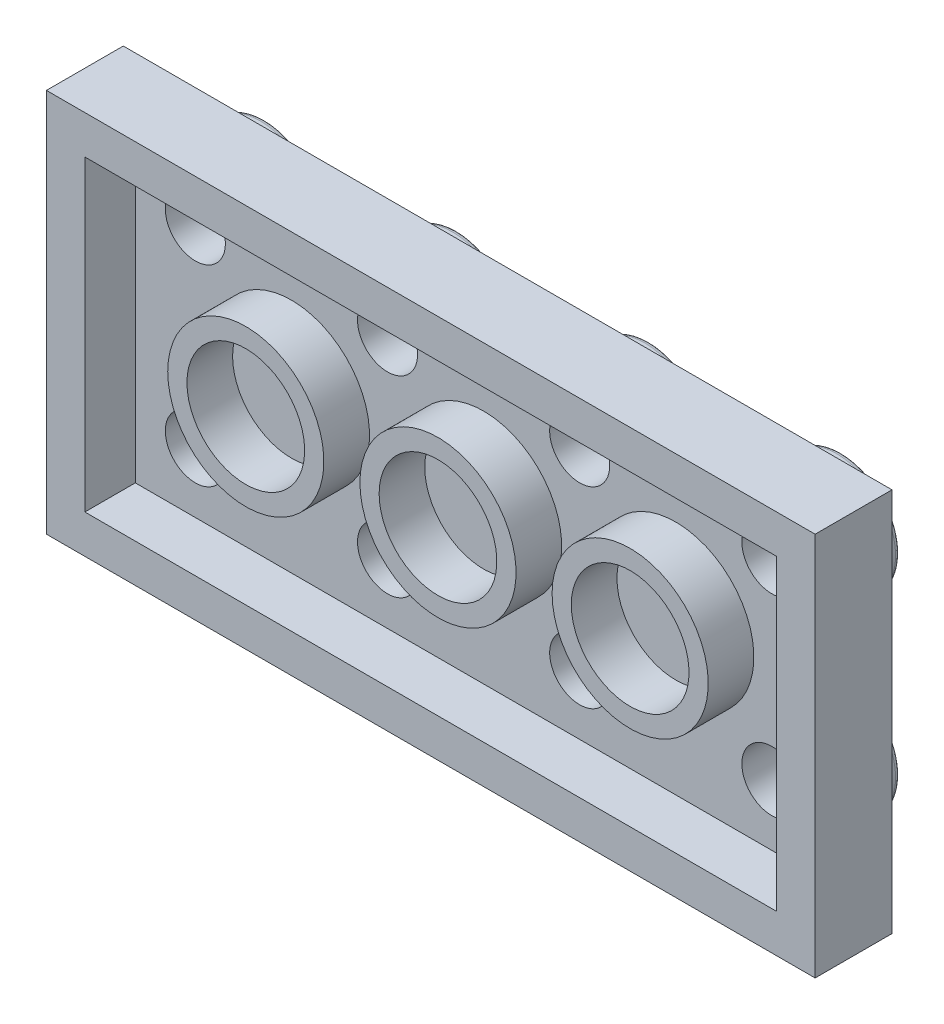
from build123d import *

# Parameters (mm, degrees)
SKIZZE1_W                         = 32
SKIZZE1_H                         = 16
LINEAR_AUSTRAGEN1_DEPTH           = 3.2
SKIZZE2_W                         = 28.8
SKIZZE2_H                         = 12.8
SCHNITT_LINEAR_AUSTRAGEN1_DEPTH   = 2.1
SKIZZE3_R                         = 3.25
SKIZZE3_R_2                       = 2.45
LINEAR_AUSTRAGEN2_DEPTH           = 1.9
SKIZZE4_R                         = 2.45
LINEAR_AUSTRAGEN3_DEPTH           = 1.9
VERRUNDUNG1_R                     = 0.2
SKIZZE9_R                         = 1.25
LINEAR_AUSTRAGEN5_DEPTH           = 1.8
SKIZZE9_2_R                       = 1.25
SCHNITT_LINEAR_AUSTRAGEN3_DEPTH   = 1.8
LINEARES_MUSTER3_COUNT            = 2
LINEARES_MUSTER3_PITCH            = 8
LINEARES_MUSTER3_COUNT_DIR2       = 4
LINEARES_MUSTER3_PITCH_DIR2       = 8
VERRUNDUNG1_OF_LINEARES_MUSTER3_R = 0.2
LINEARES_MUSTER4_COUNT            = 3
LINEARES_MUSTER4_PITCH            = 8


with BuildPart() as part:
    # Skizze1 → Linear austragen1 (new body)
    with BuildSketch(Plane.XY):
        with Locations((-16, -8)):
            Rectangle(SKIZZE1_W, SKIZZE1_H)
    extrude(amount=LINEAR_AUSTRAGEN1_DEPTH)

    # Skizze2 → Schnitt-Linear austragen1 (cut)
    with BuildSketch(Plane.XY.offset(3.2)):
        with Locations((-16, -8)):
            Rectangle(SKIZZE2_W, SKIZZE2_H)
    extrude(amount=-SCHNITT_LINEAR_AUSTRAGEN1_DEPTH, mode=Mode.SUBTRACT)

    # Skizze3 → Linear austragen2 (add)
    with BuildSketch(Plane.XY.offset(1.1)):
        with Locations(Location((-7.9, -7.80984542, 0), (0, 0, 180))):
            Circle(SKIZZE3_R)
        with Locations(Location((-7.9, -7.80984542, 0), (0, 0, 180))):
            Circle(SKIZZE3_R_2, mode=Mode.SUBTRACT)
    linear_austragen2 = extrude(amount=LINEAR_AUSTRAGEN2_DEPTH)

    # Skizze4 → Linear austragen3 (add)
    with BuildSketch(Plane(origin=(0, 0, 0), x_dir=(-1, 0, 0), z_dir=(0, 0, -1))):
        with Locations(Location((4, -4, 0), (0, 0, 180))):
            Circle(SKIZZE4_R)
    linear_austragen3 = extrude(amount=LINEAR_AUSTRAGEN3_DEPTH)

    # Verrundung1
    verrundung1_edges = [part.edges().sort_by_distance(p)[0] for p in [
        (-6.45, -4, -1.9),
    ]]
    fillet(verrundung1_edges, radius=VERRUNDUNG1_R)

    # Skizze9 → Linear austragen5 (add)
    with BuildSketch(Plane.XY.offset(1.1)):
        with Locations((-3.9, -3.9)):
            Circle(SKIZZE9_R)
    linear_austragen5 = extrude(amount=-LINEAR_AUSTRAGEN5_DEPTH)

    # Skizze9_2 → Schnitt-Linear austragen3 (cut)
    with BuildSketch(Plane.XY.offset(1.1)):
        with Locations((-3.9, -3.9)):
            Circle(SKIZZE9_2_R)
    schnitt_linear_austragen3 = extrude(amount=-SCHNITT_LINEAR_AUSTRAGEN3_DEPTH, mode=Mode.SUBTRACT)

    # Lineares Muster3: Linear austragen3, Linear austragen5, Schnitt-Linear austragen3 2 × 4
    with Locations(*[(-j * LINEARES_MUSTER3_PITCH_DIR2, -i * LINEARES_MUSTER3_PITCH, 0) for i in range(LINEARES_MUSTER3_COUNT) for j in range(LINEARES_MUSTER3_COUNT_DIR2) if (i, j) != (0, 0)]):
        add(linear_austragen3)
        add(linear_austragen5)
        add(schnitt_linear_austragen3, mode=Mode.SUBTRACT)

    # Verrundung1 of Lineares Muster3
    verrundung1_of_lineares_muster3_edges = [part.edges().sort_by_distance(p)[0] for p in [
        (-14.45, -4, -1.9),
        (-22.45, -4, -1.9),
        (-30.45, -4, -1.9),
        (-6.45, -12, -1.9),
        (-14.45, -12, -1.9),
        (-22.45, -12, -1.9),
        (-30.45, -12, -1.9),
    ]]
    fillet(verrundung1_of_lineares_muster3_edges, radius=VERRUNDUNG1_OF_LINEARES_MUSTER3_R)

    # Lineares Muster4: Linear austragen2 ×3
    with Locations(*[(-i * LINEARES_MUSTER4_PITCH, 0, 0) for i in range(1, LINEARES_MUSTER4_COUNT)]):
        add(linear_austragen2)


solid = part.part
